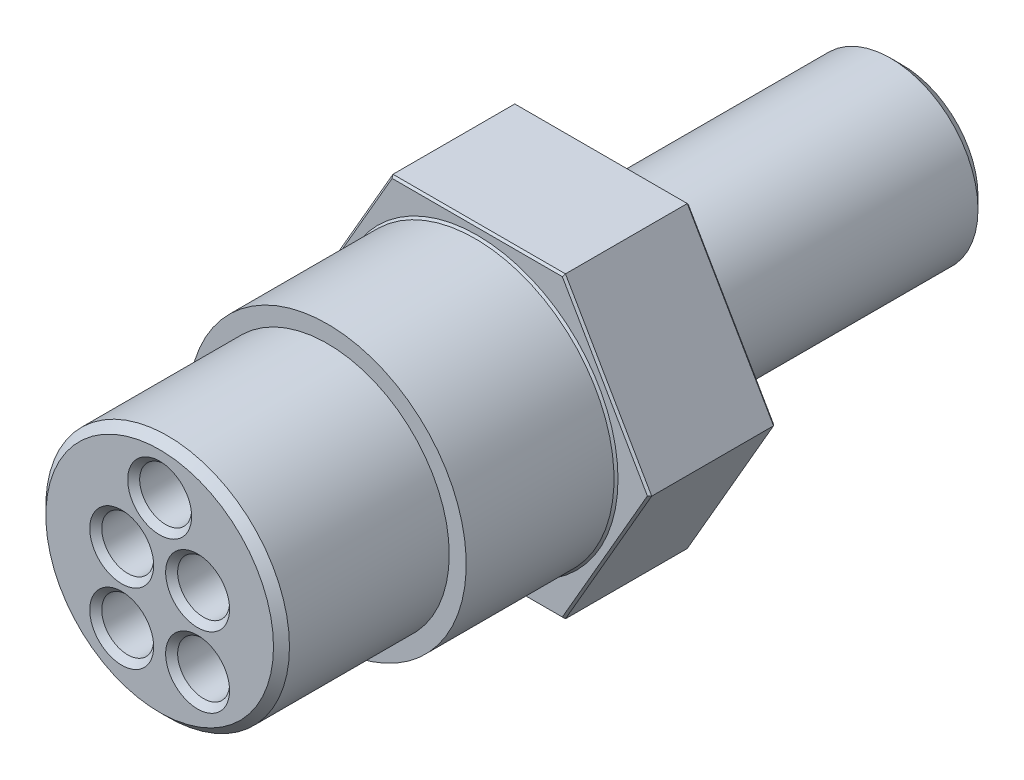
ISO-10303-21;
HEADER;
FILE_DESCRIPTION(('STEP AP214'),'2;1');
FILE_NAME('part.step','',(''),(''),'','','');
FILE_SCHEMA(('AUTOMOTIVE_DESIGN { 1 0 10303 214 1 1 1 1 }'));
ENDSEC;
DATA;
#1=APPLICATION_CONTEXT('core data for automotive mechanical design processes');
#2=APPLICATION_PROTOCOL_DEFINITION('international standard','automotive_design',2000,#1);
#3=PRODUCT_CONTEXT('',#1,'mechanical');
#4=PRODUCT('Part','Part','',(#3));
#5=PRODUCT_RELATED_PRODUCT_CATEGORY('part','',(#4));
#6=PRODUCT_DEFINITION_FORMATION('','',#4);
#7=PRODUCT_DEFINITION_CONTEXT('part definition',#1,'design');
#8=PRODUCT_DEFINITION('design','',#6,#7);
#9=PRODUCT_DEFINITION_SHAPE('','',#8);
#10=(LENGTH_UNIT() NAMED_UNIT(*) SI_UNIT(.MILLI.,.METRE.));
#11=(NAMED_UNIT(*) PLANE_ANGLE_UNIT() SI_UNIT($,.RADIAN.));
#12=(NAMED_UNIT(*) SI_UNIT($,.STERADIAN.) SOLID_ANGLE_UNIT());
#13=UNCERTAINTY_MEASURE_WITH_UNIT(LENGTH_MEASURE(1.E-05),#10,'distance_accuracy_value','');
#14=(GEOMETRIC_REPRESENTATION_CONTEXT(3) GLOBAL_UNCERTAINTY_ASSIGNED_CONTEXT((#13)) GLOBAL_UNIT_ASSIGNED_CONTEXT((#10,
#11,#12)) REPRESENTATION_CONTEXT('',''));
#15=CARTESIAN_POINT('',(0.,0.,0.));
#16=DIRECTION('',(0.,0.,1.));
#17=DIRECTION('',(1.,0.,0.));
#18=AXIS2_PLACEMENT_3D('',#15,#16,#17);
#19=CARTESIAN_POINT('',(0.,0.,17.526));
#20=DIRECTION('',(0.,0.,1.));
#21=DIRECTION('',(1.,0.,0.));
#22=AXIS2_PLACEMENT_3D('',#19,#20,#21);
#23=PLANE('',#22);
#24=CARTESIAN_POINT('',(0.,0.,17.526));
#25=DIRECTION('',(0.,0.,1.));
#26=DIRECTION('',(1.,0.,0.));
#27=AXIS2_PLACEMENT_3D('',#24,#25,#26);
#28=CIRCLE('',#27,8.8265);
#29=CARTESIAN_POINT('',(-8.8265,0.,17.526));
#30=VERTEX_POINT('',#29);
#31=EDGE_CURVE('E337',#30,#30,#28,.T.);
#32=ORIENTED_EDGE('',*,*,#31,.T.);
#33=EDGE_LOOP('',(#32));
#34=FACE_BOUND('',#33,.T.);
#35=CARTESIAN_POINT('',(0.,0.,17.526));
#36=DIRECTION('',(0.,0.,1.));
#37=DIRECTION('',(1.,0.,0.));
#38=AXIS2_PLACEMENT_3D('',#35,#36,#37);
#39=CIRCLE('',#38,7.747);
#40=CARTESIAN_POINT('',(7.747,0.,17.526));
#41=VERTEX_POINT('',#40);
#42=EDGE_CURVE('E373',#41,#41,#39,.T.);
#43=ORIENTED_EDGE('',*,*,#42,.F.);
#44=EDGE_LOOP('',(#43));
#45=FACE_BOUND('',#44,.T.);
#46=ADVANCED_FACE('F36',(#34,#45),#23,.T.);
#47=CARTESIAN_POINT('',(5.48459661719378,9.4996,8.001));
#48=DIRECTION('',(0.,0.,-1.));
#49=DIRECTION('',(-1.,0.,0.));
#50=AXIS2_PLACEMENT_3D('',#47,#48,#49);
#51=PLANE('',#50);
#52=CARTESIAN_POINT('',(0.,0.,8.001));
#53=DIRECTION('',(0.,0.,-1.));
#54=DIRECTION('',(-1.,0.,0.));
#55=AXIS2_PLACEMENT_3D('',#52,#53,#54);
#56=CIRCLE('',#55,8.95350000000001);
#57=CARTESIAN_POINT('',(-8.95350000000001,0.,8.001));
#58=VERTEX_POINT('',#57);
#59=EDGE_CURVE('E151',#58,#58,#56,.T.);
#60=ORIENTED_EDGE('',*,*,#59,.T.);
#61=EDGE_LOOP('',(#60));
#62=FACE_BOUND('',#61,.T.);
#63=DIRECTION('',(0.5,0.866025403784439,0.));
#64=VECTOR('',#63,1.);
#65=CARTESIAN_POINT('',(13.6015063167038,4.8133,8.001));
#66=LINE('',#65,#64);
#67=CARTESIAN_POINT('',(5.41127313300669,-9.3726,8.001));
#68=VERTEX_POINT('',#67);
#69=CARTESIAN_POINT('',(10.8225462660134,0.,8.001));
#70=VERTEX_POINT('',#69);
#71=EDGE_CURVE('E149',#68,#70,#66,.T.);
#72=ORIENTED_EDGE('',*,*,#71,.T.);
#73=DIRECTION('',(-0.5,0.866025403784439,0.));
#74=VECTOR('',#73,1.);
#75=CARTESIAN_POINT('',(5.37461139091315,9.4361,8.001));
#76=LINE('',#75,#74);
#77=CARTESIAN_POINT('',(5.41127313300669,9.37260000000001,8.001));
#78=VERTEX_POINT('',#77);
#79=EDGE_CURVE('E129',#70,#78,#76,.T.);
#80=ORIENTED_EDGE('',*,*,#79,.T.);
#81=DIRECTION('',(-1.,0.,0.));
#82=VECTOR('',#81,1.);
#83=CARTESIAN_POINT('',(5.48459661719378,9.37260000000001,8.001));
#84=LINE('',#83,#82);
#85=CARTESIAN_POINT('',(-5.41127313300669,9.3726,8.001));
#86=VERTEX_POINT('',#85);
#87=EDGE_CURVE('E138',#78,#86,#84,.T.);
#88=ORIENTED_EDGE('',*,*,#87,.T.);
#89=DIRECTION('',(-0.5,-0.866025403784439,0.));
#90=VECTOR('',#89,1.);
#91=CARTESIAN_POINT('',(-2.63231308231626,14.1859,8.001));
#92=LINE('',#91,#90);
#93=CARTESIAN_POINT('',(-10.8225462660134,0.,8.001));
#94=VERTEX_POINT('',#93);
#95=EDGE_CURVE('E144',#86,#94,#92,.T.);
#96=ORIENTED_EDGE('',*,*,#95,.T.);
#97=DIRECTION('',(0.5,-0.866025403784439,0.));
#98=VECTOR('',#97,1.);
#99=CARTESIAN_POINT('',(-10.8592080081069,0.0634999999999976,8.001));
#100=LINE('',#99,#98);
#101=CARTESIAN_POINT('',(-5.41127313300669,-9.3726,8.001));
#102=VERTEX_POINT('',#101);
#103=EDGE_CURVE('E313',#94,#102,#100,.T.);
#104=ORIENTED_EDGE('',*,*,#103,.T.);
#105=DIRECTION('',(1.,0.,0.));
#106=VECTOR('',#105,1.);
#107=CARTESIAN_POINT('',(5.48459661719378,-9.3726,8.001));
#108=LINE('',#107,#106);
#109=EDGE_CURVE('E156',#102,#68,#108,.T.);
#110=ORIENTED_EDGE('',*,*,#109,.T.);
#111=EDGE_LOOP('',(#72,#80,#88,#96,#104,#110));
#112=FACE_BOUND('',#111,.T.);
#113=ADVANCED_FACE('F147',(#62,#112),#51,.F.);
#114=CARTESIAN_POINT('',(0.,0.,-19.05));
#115=DIRECTION('',(0.,0.,1.));
#116=DIRECTION('',(1.,0.,0.));
#117=AXIS2_PLACEMENT_3D('',#114,#115,#116);
#118=CYLINDRICAL_SURFACE('',#117,5.55625);
#119=CARTESIAN_POINT('',(0.,0.,-18.288));
#120=DIRECTION('',(0.,0.,1.));
#121=DIRECTION('',(1.,0.,0.));
#122=AXIS2_PLACEMENT_3D('',#119,#120,#121);
#123=CIRCLE('',#122,5.55625);
#124=CARTESIAN_POINT('',(5.55625,0.,-18.288));
#125=VERTEX_POINT('',#124);
#126=EDGE_CURVE('E303',#125,#125,#123,.T.);
#127=CARTESIAN_POINT('',(0.,0.,0.));
#128=DIRECTION('',(0.,0.,1.));
#129=DIRECTION('',(1.,0.,0.));
#130=AXIS2_PLACEMENT_3D('',#127,#128,#129);
#131=CIRCLE('',#130,5.55625);
#132=CARTESIAN_POINT('',(5.55625,0.,0.));
#133=VERTEX_POINT('',#132);
#134=EDGE_CURVE('E308',#133,#133,#131,.T.);
#135=CARTESIAN_POINT('',(5.55625,0.,-18.288));
#136=CARTESIAN_POINT('',(5.55625,0.,-18.0975));
#137=CARTESIAN_POINT('',(5.55625,0.,-17.907));
#138=CARTESIAN_POINT('',(5.55625,0.,-17.526));
#139=CARTESIAN_POINT('',(5.55625,0.,-17.3355));
#140=CARTESIAN_POINT('',(5.55625,0.,-16.9545));
#141=CARTESIAN_POINT('',(5.55625,0.,-16.764));
#142=CARTESIAN_POINT('',(5.55625,0.,-16.383));
#143=CARTESIAN_POINT('',(5.55625,0.,-16.1925));
#144=CARTESIAN_POINT('',(5.55625,0.,-15.8115));
#145=CARTESIAN_POINT('',(5.55625,0.,-15.621));
#146=CARTESIAN_POINT('',(5.55625,0.,-15.24));
#147=CARTESIAN_POINT('',(5.55625,0.,-15.0495));
#148=CARTESIAN_POINT('',(5.55625,0.,-14.6685));
#149=CARTESIAN_POINT('',(5.55625,0.,-14.478));
#150=CARTESIAN_POINT('',(5.55625,0.,-14.097));
#151=CARTESIAN_POINT('',(5.55625,0.,-13.9065));
#152=CARTESIAN_POINT('',(5.55625,0.,-13.5255));
#153=CARTESIAN_POINT('',(5.55625,0.,-13.335));
#154=CARTESIAN_POINT('',(5.55625,0.,-12.954));
#155=CARTESIAN_POINT('',(5.55625,0.,-12.7635));
#156=CARTESIAN_POINT('',(5.55625,0.,-12.3825));
#157=CARTESIAN_POINT('',(5.55625,0.,-12.192));
#158=CARTESIAN_POINT('',(5.55625,0.,-11.811));
#159=CARTESIAN_POINT('',(5.55625,0.,-11.6205));
#160=CARTESIAN_POINT('',(5.55625,0.,-11.2395));
#161=CARTESIAN_POINT('',(5.55625,0.,-11.049));
#162=CARTESIAN_POINT('',(5.55625,0.,-10.668));
#163=CARTESIAN_POINT('',(5.55625,0.,-10.4775));
#164=CARTESIAN_POINT('',(5.55625,0.,-10.0965));
#165=CARTESIAN_POINT('',(5.55625,0.,-9.906));
#166=CARTESIAN_POINT('',(5.55625,0.,-9.525));
#167=CARTESIAN_POINT('',(5.55625,0.,-9.3345));
#168=CARTESIAN_POINT('',(5.55625,0.,-8.9535));
#169=CARTESIAN_POINT('',(5.55625,0.,-8.763));
#170=CARTESIAN_POINT('',(5.55625,0.,-8.382));
#171=CARTESIAN_POINT('',(5.55625,0.,-8.1915));
#172=CARTESIAN_POINT('',(5.55625,0.,-7.8105));
#173=CARTESIAN_POINT('',(5.55625,0.,-7.62));
#174=CARTESIAN_POINT('',(5.55625,0.,-7.239));
#175=CARTESIAN_POINT('',(5.55625,0.,-7.0485));
#176=CARTESIAN_POINT('',(5.55625,0.,-6.6675));
#177=CARTESIAN_POINT('',(5.55625,0.,-6.477));
#178=CARTESIAN_POINT('',(5.55625,0.,-6.096));
#179=CARTESIAN_POINT('',(5.55625,0.,-5.9055));
#180=CARTESIAN_POINT('',(5.55625,0.,-5.5245));
#181=CARTESIAN_POINT('',(5.55625,0.,-5.334));
#182=CARTESIAN_POINT('',(5.55625,0.,-4.953));
#183=CARTESIAN_POINT('',(5.55625,0.,-4.7625));
#184=CARTESIAN_POINT('',(5.55625,0.,-4.3815));
#185=CARTESIAN_POINT('',(5.55625,0.,-4.191));
#186=CARTESIAN_POINT('',(5.55625,0.,-3.81));
#187=CARTESIAN_POINT('',(5.55625,0.,-3.6195));
#188=CARTESIAN_POINT('',(5.55625,0.,-3.2385));
#189=CARTESIAN_POINT('',(5.55625,0.,-3.048));
#190=CARTESIAN_POINT('',(5.55625,0.,-2.667));
#191=CARTESIAN_POINT('',(5.55625,0.,-2.4765));
#192=CARTESIAN_POINT('',(5.55625,0.,-2.0955));
#193=CARTESIAN_POINT('',(5.55625,0.,-1.905));
#194=CARTESIAN_POINT('',(5.55625,0.,-1.524));
#195=CARTESIAN_POINT('',(5.55625,0.,-1.3335));
#196=CARTESIAN_POINT('',(5.55625,0.,-0.952499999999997));
#197=CARTESIAN_POINT('',(5.55625,0.,-0.761999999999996));
#198=CARTESIAN_POINT('',(5.55625,0.,-0.380999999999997));
#199=CARTESIAN_POINT('',(5.55625,0.,-0.190499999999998));
#200=CARTESIAN_POINT('',(5.55625,0.,0.));
#201=B_SPLINE_CURVE_WITH_KNOTS('',3,(#135,#136,#137,#138,#139,#140,#141,#142,#143,#144,#145,
#146,#147,#148,#149,#150,#151,#152,#153,#154,#155,#156,#157,#158,#159,#160,#161,#162,#163,#164,
#165,#166,#167,#168,#169,#170,#171,#172,#173,#174,#175,#176,#177,#178,#179,#180,#181,#182,#183,
#184,#185,#186,#187,#188,#189,#190,#191,#192,#193,#194,#195,#196,#197,#198,#199,#200),
.UNSPECIFIED.,.F.,.F.,(4,2,2,2,2,2,2,2,2,2,2,2,2,2,2,2,2,2,2,2,2,2,2,2,2,2,2,2,2,2,2,2,4),(0.,
0.571500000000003,1.143,1.7145,2.286,2.8575,3.429,4.0005,4.572,5.1435,5.715,6.2865,6.858,7.4295,
8.001,8.5725,9.144,9.7155,10.287,10.8585,11.43,12.0015,12.573,13.1445,13.716,14.2875,14.859,
15.4305,16.002,16.5735,17.145,17.7165,18.288),.UNSPECIFIED.);
#202=EDGE_CURVE('BSEAM38',#125,#133,#201,.T.);
#203=ORIENTED_EDGE('',*,*,#126,.T.);
#204=ORIENTED_EDGE('',*,*,#134,.F.);
#205=ORIENTED_EDGE('',*,*,#202,.T.);
#206=ORIENTED_EDGE('',*,*,#202,.F.);
#207=EDGE_LOOP('',(#203,#205,#204,#206));
#208=FACE_BOUND('',#207,.T.);
#209=ADVANCED_FACE('F38',(#208),#118,.T.);
#210=CARTESIAN_POINT('',(0.,0.,-19.05));
#211=DIRECTION('',(0.,0.,1.));
#212=DIRECTION('',(1.,0.,0.));
#213=AXIS2_PLACEMENT_3D('',#210,#211,#212);
#214=PLANE('',#213);
#215=CARTESIAN_POINT('',(0.,0.,-19.05));
#216=DIRECTION('',(0.,0.,1.));
#217=DIRECTION('',(1.,0.,0.));
#218=AXIS2_PLACEMENT_3D('',#215,#216,#217);
#219=CIRCLE('',#218,4.79425);
#220=CARTESIAN_POINT('',(4.79425,0.,-19.05));
#221=VERTEX_POINT('',#220);
#222=EDGE_CURVE('E302',#221,#221,#219,.F.);
#223=ORIENTED_EDGE('',*,*,#222,.T.);
#224=EDGE_LOOP('',(#223));
#225=FACE_BOUND('',#224,.T.);
#226=ADVANCED_FACE('F292',(#225),#214,.F.);
#227=CARTESIAN_POINT('',(0.,0.,-18.288));
#228=DIRECTION('',(0.,0.,1.));
#229=DIRECTION('',(1.,0.,0.));
#230=AXIS2_PLACEMENT_3D('',#227,#228,#229);
#231=CONICAL_SURFACE('',#230,5.55625,0.785398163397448);
#232=ORIENTED_EDGE('',*,*,#222,.F.);
#233=EDGE_LOOP('',(#232));
#234=FACE_BOUND('',#233,.T.);
#235=ORIENTED_EDGE('',*,*,#126,.F.);
#236=EDGE_LOOP('',(#235));
#237=FACE_BOUND('',#236,.T.);
#238=ADVANCED_FACE('F289',(#234,#237),#231,.T.);
#239=CARTESIAN_POINT('',(5.48459661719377,9.4996,8.001));
#240=DIRECTION('',(0.,-1.,0.));
#241=DIRECTION('',(1.,0.,0.));
#242=AXIS2_PLACEMENT_3D('',#239,#240,#241);
#243=PLANE('',#242);
#244=DIRECTION('',(0.,0.,-1.));
#245=VECTOR('',#244,1.);
#246=CARTESIAN_POINT('',(-5.48459661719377,9.4996,8.001));
#247=LINE('',#246,#245);
#248=CARTESIAN_POINT('',(-5.48459661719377,9.4996,7.874));
#249=VERTEX_POINT('',#248);
#250=CARTESIAN_POINT('',(-5.48459661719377,9.4996,0.126999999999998));
#251=VERTEX_POINT('',#250);
#252=EDGE_CURVE('E357',#249,#251,#247,.T.);
#253=ORIENTED_EDGE('',*,*,#252,.F.);
#254=DIRECTION('',(1.,0.,0.));
#255=VECTOR('',#254,1.);
#256=CARTESIAN_POINT('',(5.48459661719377,9.4996,7.874));
#257=LINE('',#256,#255);
#258=CARTESIAN_POINT('',(5.48459661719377,9.4996,7.874));
#259=VERTEX_POINT('',#258);
#260=EDGE_CURVE('E183',#249,#259,#257,.T.);
#261=ORIENTED_EDGE('',*,*,#260,.T.);
#262=DIRECTION('',(0.,0.,-1.));
#263=VECTOR('',#262,1.);
#264=CARTESIAN_POINT('',(5.48459661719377,9.4996,8.001));
#265=LINE('',#264,#263);
#266=CARTESIAN_POINT('',(5.48459661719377,9.4996,0.127));
#267=VERTEX_POINT('',#266);
#268=EDGE_CURVE('E342',#259,#267,#265,.T.);
#269=ORIENTED_EDGE('',*,*,#268,.T.);
#270=DIRECTION('',(-1.,0.,0.));
#271=VECTOR('',#270,1.);
#272=CARTESIAN_POINT('',(-5.48459661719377,9.4996,0.127));
#273=LINE('',#272,#271);
#274=EDGE_CURVE('E180',#267,#251,#273,.T.);
#275=ORIENTED_EDGE('',*,*,#274,.T.);
#276=EDGE_LOOP('',(#253,#261,#269,#275));
#277=FACE_BOUND('',#276,.T.);
#278=ADVANCED_FACE('F285',(#277),#243,.F.);
#279=CARTESIAN_POINT('',(-5.48459661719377,9.4996,8.001));
#280=DIRECTION('',(0.866025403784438,-0.5,0.));
#281=DIRECTION('',(0.5,0.866025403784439,0.));
#282=AXIS2_PLACEMENT_3D('',#279,#280,#281);
#283=PLANE('',#282);
#284=DIRECTION('',(0.,0.,-1.));
#285=VECTOR('',#284,1.);
#286=CARTESIAN_POINT('',(-10.9691932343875,0.,8.001));
#287=LINE('',#286,#285);
#288=CARTESIAN_POINT('',(-10.9691932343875,0.,7.874));
#289=VERTEX_POINT('',#288);
#290=CARTESIAN_POINT('',(-10.9691932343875,0.,0.127000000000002));
#291=VERTEX_POINT('',#290);
#292=EDGE_CURVE('E354',#289,#291,#287,.T.);
#293=ORIENTED_EDGE('',*,*,#292,.F.);
#294=DIRECTION('',(0.5,0.866025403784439,0.));
#295=VECTOR('',#294,1.);
#296=CARTESIAN_POINT('',(-5.48459661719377,9.4996,7.874));
#297=LINE('',#296,#295);
#298=EDGE_CURVE('E178',#289,#249,#297,.T.);
#299=ORIENTED_EDGE('',*,*,#298,.T.);
#300=ORIENTED_EDGE('',*,*,#252,.T.);
#301=DIRECTION('',(-0.377964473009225,-0.654653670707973,-0.654653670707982));
#302=VECTOR('',#301,1.);
#303=CARTESIAN_POINT('',(-3.91756901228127,12.2137714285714,2.84117142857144));
#304=LINE('',#303,#302);
#305=CARTESIAN_POINT('',(-5.55792010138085,9.3726,0.));
#306=VERTEX_POINT('',#305);
#307=EDGE_CURVE('E176',#251,#306,#304,.T.);
#308=ORIENTED_EDGE('',*,*,#307,.T.);
#309=DIRECTION('',(-0.5,-0.866025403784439,0.));
#310=VECTOR('',#309,1.);
#311=CARTESIAN_POINT('',(-5.48459661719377,9.4996,0.));
#312=LINE('',#311,#310);
#313=CARTESIAN_POINT('',(-10.8958697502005,0.127000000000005,0.));
#314=VERTEX_POINT('',#313);
#315=EDGE_CURVE('E339',#306,#314,#312,.T.);
#316=ORIENTED_EDGE('',*,*,#315,.T.);
#317=DIRECTION('',(-0.377964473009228,-0.654653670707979,0.654653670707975));
#318=VECTOR('',#317,1.);
#319=CARTESIAN_POINT('',(-10.9691932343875,0.,0.127000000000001));
#320=LINE('',#319,#318);
#321=EDGE_CURVE('E174',#314,#291,#320,.T.);
#322=ORIENTED_EDGE('',*,*,#321,.T.);
#323=EDGE_LOOP('',(#293,#299,#300,#308,#316,#322));
#324=FACE_BOUND('',#323,.T.);
#325=ADVANCED_FACE('F281',(#324),#283,.F.);
#326=CARTESIAN_POINT('',(-10.9691932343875,0.,8.001));
#327=DIRECTION('',(0.866025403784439,0.5,0.));
#328=DIRECTION('',(-0.5,0.866025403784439,0.));
#329=AXIS2_PLACEMENT_3D('',#326,#327,#328);
#330=PLANE('',#329);
#331=DIRECTION('',(0.,0.,-1.));
#332=VECTOR('',#331,1.);
#333=CARTESIAN_POINT('',(-5.48459661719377,-9.4996,8.001));
#334=LINE('',#333,#332);
#335=CARTESIAN_POINT('',(-5.48459661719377,-9.4996,7.874));
#336=VERTEX_POINT('',#335);
#337=CARTESIAN_POINT('',(-5.48459661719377,-9.4996,0.127));
#338=VERTEX_POINT('',#337);
#339=EDGE_CURVE('E351',#336,#338,#334,.T.);
#340=ORIENTED_EDGE('',*,*,#339,.F.);
#341=DIRECTION('',(-0.5,0.866025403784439,0.));
#342=VECTOR('',#341,1.);
#343=CARTESIAN_POINT('',(-10.9691932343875,0.,7.874));
#344=LINE('',#343,#342);
#345=EDGE_CURVE('E172',#336,#289,#344,.T.);
#346=ORIENTED_EDGE('',*,*,#345,.T.);
#347=ORIENTED_EDGE('',*,*,#292,.T.);
#348=DIRECTION('',(0.5,-0.866025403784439,0.));
#349=VECTOR('',#348,1.);
#350=CARTESIAN_POINT('',(-5.48459661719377,-9.4996,0.127));
#351=LINE('',#350,#349);
#352=EDGE_CURVE('E170',#291,#338,#351,.T.);
#353=ORIENTED_EDGE('',*,*,#352,.T.);
#354=EDGE_LOOP('',(#340,#346,#347,#353));
#355=FACE_BOUND('',#354,.T.);
#356=ADVANCED_FACE('F277',(#355),#330,.F.);
#357=CARTESIAN_POINT('',(-5.48459661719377,-9.4996,8.001));
#358=DIRECTION('',(0.,1.,0.));
#359=DIRECTION('',(-1.,0.,0.));
#360=AXIS2_PLACEMENT_3D('',#357,#358,#359);
#361=PLANE('',#360);
#362=DIRECTION('',(0.,0.,-1.));
#363=VECTOR('',#362,1.);
#364=CARTESIAN_POINT('',(5.48459661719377,-9.4996,8.001));
#365=LINE('',#364,#363);
#366=CARTESIAN_POINT('',(5.48459661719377,-9.4996,7.874));
#367=VERTEX_POINT('',#366);
#368=CARTESIAN_POINT('',(5.48459661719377,-9.4996,0.127));
#369=VERTEX_POINT('',#368);
#370=EDGE_CURVE('E348',#367,#369,#365,.T.);
#371=ORIENTED_EDGE('',*,*,#370,.F.);
#372=DIRECTION('',(-1.,0.,0.));
#373=VECTOR('',#372,1.);
#374=CARTESIAN_POINT('',(-5.48459661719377,-9.4996,7.874));
#375=LINE('',#374,#373);
#376=EDGE_CURVE('E168',#367,#336,#375,.T.);
#377=ORIENTED_EDGE('',*,*,#376,.T.);
#378=ORIENTED_EDGE('',*,*,#339,.T.);
#379=DIRECTION('',(1.,0.,0.));
#380=VECTOR('',#379,1.);
#381=CARTESIAN_POINT('',(5.48459661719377,-9.4996,0.127));
#382=LINE('',#381,#380);
#383=EDGE_CURVE('E166',#338,#369,#382,.T.);
#384=ORIENTED_EDGE('',*,*,#383,.T.);
#385=EDGE_LOOP('',(#371,#377,#378,#384));
#386=FACE_BOUND('',#385,.T.);
#387=ADVANCED_FACE('F273',(#386),#361,.F.);
#388=CARTESIAN_POINT('',(5.48459661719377,-9.4996,8.001));
#389=DIRECTION('',(-0.866025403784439,0.5,0.));
#390=DIRECTION('',(-0.5,-0.866025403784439,0.));
#391=AXIS2_PLACEMENT_3D('',#388,#389,#390);
#392=PLANE('',#391);
#393=DIRECTION('',(0.,0.,-1.));
#394=VECTOR('',#393,1.);
#395=CARTESIAN_POINT('',(10.9691932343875,0.,8.001));
#396=LINE('',#395,#394);
#397=CARTESIAN_POINT('',(10.9691932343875,0.,7.874));
#398=VERTEX_POINT('',#397);
#399=CARTESIAN_POINT('',(10.9691932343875,0.,0.127));
#400=VERTEX_POINT('',#399);
#401=EDGE_CURVE('E345',#398,#400,#396,.T.);
#402=ORIENTED_EDGE('',*,*,#401,.F.);
#403=DIRECTION('',(-0.5,-0.866025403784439,0.));
#404=VECTOR('',#403,1.);
#405=CARTESIAN_POINT('',(5.48459661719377,-9.4996,7.874));
#406=LINE('',#405,#404);
#407=EDGE_CURVE('E164',#398,#367,#406,.T.);
#408=ORIENTED_EDGE('',*,*,#407,.T.);
#409=ORIENTED_EDGE('',*,*,#370,.T.);
#410=DIRECTION('',(0.5,0.866025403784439,0.));
#411=VECTOR('',#410,1.);
#412=CARTESIAN_POINT('',(10.9691932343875,0.,0.127));
#413=LINE('',#412,#411);
#414=EDGE_CURVE('E162',#369,#400,#413,.T.);
#415=ORIENTED_EDGE('',*,*,#414,.T.);
#416=EDGE_LOOP('',(#402,#408,#409,#415));
#417=FACE_BOUND('',#416,.T.);
#418=ADVANCED_FACE('F269',(#417),#392,.F.);
#419=CARTESIAN_POINT('',(10.9691932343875,0.,8.001));
#420=DIRECTION('',(-0.866025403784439,-0.5,0.));
#421=DIRECTION('',(0.5,-0.866025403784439,0.));
#422=AXIS2_PLACEMENT_3D('',#419,#420,#421);
#423=PLANE('',#422);
#424=ORIENTED_EDGE('',*,*,#268,.F.);
#425=DIRECTION('',(0.5,-0.866025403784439,0.));
#426=VECTOR('',#425,1.);
#427=CARTESIAN_POINT('',(10.9691932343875,0.,7.874));
#428=LINE('',#427,#426);
#429=EDGE_CURVE('E131',#259,#398,#428,.T.);
#430=ORIENTED_EDGE('',*,*,#429,.T.);
#431=ORIENTED_EDGE('',*,*,#401,.T.);
#432=DIRECTION('',(-0.5,0.866025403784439,0.));
#433=VECTOR('',#432,1.);
#434=CARTESIAN_POINT('',(5.48459661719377,9.4996,0.127));
#435=LINE('',#434,#433);
#436=EDGE_CURVE('E154',#400,#267,#435,.T.);
#437=ORIENTED_EDGE('',*,*,#436,.T.);
#438=EDGE_LOOP('',(#424,#430,#431,#437));
#439=FACE_BOUND('',#438,.T.);
#440=ADVANCED_FACE('F264',(#439),#423,.F.);
#441=CARTESIAN_POINT('',(5.48459661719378,9.4996,0.));
#442=DIRECTION('',(0.,0.,-1.));
#443=DIRECTION('',(-1.,0.,0.));
#444=AXIS2_PLACEMENT_3D('',#441,#442,#443);
#445=PLANE('',#444);
#446=ORIENTED_EDGE('',*,*,#134,.T.);
#447=EDGE_LOOP('',(#446));
#448=FACE_BOUND('',#447,.T.);
#449=ORIENTED_EDGE('',*,*,#315,.F.);
#450=DIRECTION('',(1.,0.,0.));
#451=VECTOR('',#450,1.);
#452=CARTESIAN_POINT('',(5.48459661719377,9.37260000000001,0.));
#453=LINE('',#452,#451);
#454=CARTESIAN_POINT('',(5.41127313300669,9.37260000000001,0.));
#455=VERTEX_POINT('',#454);
#456=EDGE_CURVE('E51',#306,#455,#453,.T.);
#457=ORIENTED_EDGE('',*,*,#456,.T.);
#458=DIRECTION('',(0.5,-0.866025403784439,0.));
#459=VECTOR('',#458,1.);
#460=CARTESIAN_POINT('',(10.8592080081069,-0.0634999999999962,0.));
#461=LINE('',#460,#459);
#462=CARTESIAN_POINT('',(10.8225462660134,0.,0.));
#463=VERTEX_POINT('',#462);
#464=EDGE_CURVE('E55',#455,#463,#461,.T.);
#465=ORIENTED_EDGE('',*,*,#464,.T.);
#466=DIRECTION('',(-0.5,-0.866025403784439,0.));
#467=VECTOR('',#466,1.);
#468=CARTESIAN_POINT('',(5.37461139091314,-9.43609999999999,0.));
#469=LINE('',#468,#467);
#470=CARTESIAN_POINT('',(5.41127313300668,-9.3726,0.));
#471=VERTEX_POINT('',#470);
#472=EDGE_CURVE('E189',#463,#471,#469,.T.);
#473=ORIENTED_EDGE('',*,*,#472,.T.);
#474=DIRECTION('',(-1.,0.,0.));
#475=VECTOR('',#474,1.);
#476=CARTESIAN_POINT('',(-5.48459661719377,-9.3726,0.));
#477=LINE('',#476,#475);
#478=CARTESIAN_POINT('',(-5.41127313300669,-9.3726,0.));
#479=VERTEX_POINT('',#478);
#480=EDGE_CURVE('E187',#471,#479,#477,.T.);
#481=ORIENTED_EDGE('',*,*,#480,.T.);
#482=DIRECTION('',(-0.5,0.866025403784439,0.));
#483=VECTOR('',#482,1.);
#484=CARTESIAN_POINT('',(-10.8592080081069,0.0635000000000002,0.));
#485=LINE('',#484,#483);
#486=EDGE_CURVE('E185',#479,#314,#485,.T.);
#487=ORIENTED_EDGE('',*,*,#486,.T.);
#488=EDGE_LOOP('',(#449,#457,#465,#473,#481,#487));
#489=FACE_BOUND('',#488,.T.);
#490=ADVANCED_FACE('F261',(#448,#489),#445,.T.);
#491=CARTESIAN_POINT('',(0.,0.,17.526));
#492=DIRECTION('',(0.,0.,-1.));
#493=DIRECTION('',(-1.,0.,0.));
#494=AXIS2_PLACEMENT_3D('',#491,#492,#493);
#495=CYLINDRICAL_SURFACE('',#494,8.8265);
#496=CARTESIAN_POINT('',(0.,0.,8.12800000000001));
#497=DIRECTION('',(0.,0.,-1.));
#498=DIRECTION('',(-1.,0.,0.));
#499=AXIS2_PLACEMENT_3D('',#496,#497,#498);
#500=CIRCLE('',#499,8.8265);
#501=CARTESIAN_POINT('',(-8.8265,0.,8.12800000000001));
#502=VERTEX_POINT('',#501);
#503=EDGE_CURVE('E145',#502,#502,#500,.F.);
#504=CARTESIAN_POINT('',(-8.8265,0.,8.12800000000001));
#505=CARTESIAN_POINT('',(-8.8265,0.,8.22589583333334));
#506=CARTESIAN_POINT('',(-8.8265,0.,8.32379166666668));
#507=CARTESIAN_POINT('',(-8.8265,0.,8.51958333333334));
#508=CARTESIAN_POINT('',(-8.8265,0.,8.61747916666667));
#509=CARTESIAN_POINT('',(-8.8265,0.,8.81327083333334));
#510=CARTESIAN_POINT('',(-8.8265,0.,8.91116666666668));
#511=CARTESIAN_POINT('',(-8.8265,0.,9.10695833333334));
#512=CARTESIAN_POINT('',(-8.8265,0.,9.20485416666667));
#513=CARTESIAN_POINT('',(-8.8265,0.,9.40064583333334));
#514=CARTESIAN_POINT('',(-8.8265,0.,9.49854166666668));
#515=CARTESIAN_POINT('',(-8.8265,0.,9.69433333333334));
#516=CARTESIAN_POINT('',(-8.8265,0.,9.79222916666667));
#517=CARTESIAN_POINT('',(-8.8265,0.,9.98802083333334));
#518=CARTESIAN_POINT('',(-8.8265,0.,10.0859166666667));
#519=CARTESIAN_POINT('',(-8.8265,0.,10.2817083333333));
#520=CARTESIAN_POINT('',(-8.8265,0.,10.3796041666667));
#521=CARTESIAN_POINT('',(-8.8265,0.,10.5753958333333));
#522=CARTESIAN_POINT('',(-8.8265,0.,10.6732916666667));
#523=CARTESIAN_POINT('',(-8.8265,0.,10.8690833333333));
#524=CARTESIAN_POINT('',(-8.8265,0.,10.9669791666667));
#525=CARTESIAN_POINT('',(-8.8265,0.,11.1627708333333));
#526=CARTESIAN_POINT('',(-8.8265,0.,11.2606666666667));
#527=CARTESIAN_POINT('',(-8.8265,0.,11.4564583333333));
#528=CARTESIAN_POINT('',(-8.8265,0.,11.5543541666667));
#529=CARTESIAN_POINT('',(-8.8265,0.,11.7501458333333));
#530=CARTESIAN_POINT('',(-8.8265,0.,11.8480416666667));
#531=CARTESIAN_POINT('',(-8.8265,0.,12.0438333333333));
#532=CARTESIAN_POINT('',(-8.8265,0.,12.1417291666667));
#533=CARTESIAN_POINT('',(-8.8265,0.,12.3375208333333));
#534=CARTESIAN_POINT('',(-8.8265,0.,12.4354166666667));
#535=CARTESIAN_POINT('',(-8.8265,0.,12.6312083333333));
#536=CARTESIAN_POINT('',(-8.8265,0.,12.7291041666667));
#537=CARTESIAN_POINT('',(-8.8265,0.,12.9248958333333));
#538=CARTESIAN_POINT('',(-8.8265,0.,13.0227916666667));
#539=CARTESIAN_POINT('',(-8.8265,0.,13.2185833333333));
#540=CARTESIAN_POINT('',(-8.8265,0.,13.3164791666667));
#541=CARTESIAN_POINT('',(-8.8265,0.,13.5122708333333));
#542=CARTESIAN_POINT('',(-8.8265,0.,13.6101666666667));
#543=CARTESIAN_POINT('',(-8.8265,0.,13.8059583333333));
#544=CARTESIAN_POINT('',(-8.8265,0.,13.9038541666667));
#545=CARTESIAN_POINT('',(-8.8265,0.,14.0996458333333));
#546=CARTESIAN_POINT('',(-8.8265,0.,14.1975416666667));
#547=CARTESIAN_POINT('',(-8.8265,0.,14.3933333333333));
#548=CARTESIAN_POINT('',(-8.8265,0.,14.4912291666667));
#549=CARTESIAN_POINT('',(-8.8265,0.,14.6870208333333));
#550=CARTESIAN_POINT('',(-8.8265,0.,14.7849166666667));
#551=CARTESIAN_POINT('',(-8.8265,0.,14.9807083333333));
#552=CARTESIAN_POINT('',(-8.8265,0.,15.0786041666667));
#553=CARTESIAN_POINT('',(-8.8265,0.,15.2743958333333));
#554=CARTESIAN_POINT('',(-8.8265,0.,15.3722916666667));
#555=CARTESIAN_POINT('',(-8.8265,0.,15.5680833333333));
#556=CARTESIAN_POINT('',(-8.8265,0.,15.6659791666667));
#557=CARTESIAN_POINT('',(-8.8265,0.,15.8617708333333));
#558=CARTESIAN_POINT('',(-8.8265,0.,15.9596666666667));
#559=CARTESIAN_POINT('',(-8.8265,0.,16.1554583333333));
#560=CARTESIAN_POINT('',(-8.8265,0.,16.2533541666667));
#561=CARTESIAN_POINT('',(-8.8265,0.,16.4491458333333));
#562=CARTESIAN_POINT('',(-8.8265,0.,16.5470416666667));
#563=CARTESIAN_POINT('',(-8.8265,0.,16.7428333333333));
#564=CARTESIAN_POINT('',(-8.8265,0.,16.8407291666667));
#565=CARTESIAN_POINT('',(-8.8265,0.,17.0365208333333));
#566=CARTESIAN_POINT('',(-8.8265,0.,17.1344166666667));
#567=CARTESIAN_POINT('',(-8.8265,0.,17.3302083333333));
#568=CARTESIAN_POINT('',(-8.8265,0.,17.4281041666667));
#569=CARTESIAN_POINT('',(-8.8265,0.,17.526));
#570=B_SPLINE_CURVE_WITH_KNOTS('',3,(#504,#505,#506,#507,#508,#509,#510,#511,#512,#513,#514,
#515,#516,#517,#518,#519,#520,#521,#522,#523,#524,#525,#526,#527,#528,#529,#530,#531,#532,#533,
#534,#535,#536,#537,#538,#539,#540,#541,#542,#543,#544,#545,#546,#547,#548,#549,#550,#551,#552,
#553,#554,#555,#556,#557,#558,#559,#560,#561,#562,#563,#564,#565,#566,#567,#568,#569),
.UNSPECIFIED.,.F.,.F.,(4,2,2,2,2,2,2,2,2,2,2,2,2,2,2,2,2,2,2,2,2,2,2,2,2,2,2,2,2,2,2,2,4),(0.,
0.293687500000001,0.587374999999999,0.8810625,1.17475,1.4684375,1.762125,2.0558125,2.3495,
2.6431875,2.936875,3.2305625,3.52425,3.81793749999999,4.111625,4.4053125,4.69899999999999,
4.99268749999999,5.28637499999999,5.58006249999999,5.87374999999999,6.16743749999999,
6.46112499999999,6.75481249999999,7.04849999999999,7.34218749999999,7.63587499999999,
7.92956249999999,8.22324999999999,8.51693749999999,8.81062499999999,9.10431249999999,
9.39799999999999),.UNSPECIFIED.);
#571=EDGE_CURVE('BSEAM258',#502,#30,#570,.T.);
#572=ORIENTED_EDGE('',*,*,#503,.T.);
#573=ORIENTED_EDGE('',*,*,#31,.F.);
#574=ORIENTED_EDGE('',*,*,#571,.T.);
#575=ORIENTED_EDGE('',*,*,#571,.F.);
#576=EDGE_LOOP('',(#572,#574,#573,#575));
#577=FACE_BOUND('',#576,.T.);
#578=ADVANCED_FACE('F258',(#577),#495,.T.);
#579=CARTESIAN_POINT('',(0.,0.,8.12800000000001));
#580=DIRECTION('',(0.,0.,-1.));
#581=DIRECTION('',(-1.,0.,0.));
#582=AXIS2_PLACEMENT_3D('',#579,#580,#581);
#583=CONICAL_SURFACE('',#582,8.8265,0.785398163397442);
#584=ORIENTED_EDGE('',*,*,#59,.F.);
#585=EDGE_LOOP('',(#584));
#586=FACE_BOUND('',#585,.T.);
#587=ORIENTED_EDGE('',*,*,#503,.F.);
#588=EDGE_LOOP('',(#587));
#589=FACE_BOUND('',#588,.T.);
#590=ADVANCED_FACE('F256',(#586,#589),#583,.T.);
#591=CARTESIAN_POINT('',(-10.8592080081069,0.0634999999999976,8.001));
#592=DIRECTION('',(0.612372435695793,0.353553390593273,-0.707106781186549));
#593=DIRECTION('',(-0.755928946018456,0.,-0.654653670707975));
#594=AXIS2_PLACEMENT_3D('',#591,#592,#593);
#595=PLANE('',#594);
#596=DIRECTION('',(0.755928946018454,0.,0.654653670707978));
#597=VECTOR('',#596,1.);
#598=CARTESIAN_POINT('',(-6.14241301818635,0.,12.0541142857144));
#599=LINE('',#598,#597);
#600=EDGE_CURVE('E326',#289,#94,#599,.T.);
#601=ORIENTED_EDGE('',*,*,#600,.F.);
#602=ORIENTED_EDGE('',*,*,#345,.F.);
#603=DIRECTION('',(0.377964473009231,0.654653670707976,0.654653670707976));
#604=VECTOR('',#603,1.);
#605=CARTESIAN_POINT('',(-3.85472031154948,-6.67657142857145,10.6970285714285));
#606=LINE('',#605,#604);
#607=EDGE_CURVE('E335',#102,#336,#606,.F.);
#608=ORIENTED_EDGE('',*,*,#607,.F.);
#609=ORIENTED_EDGE('',*,*,#103,.F.);
#610=EDGE_LOOP('',(#601,#602,#608,#609));
#611=FACE_BOUND('',#610,.T.);
#612=ADVANCED_FACE('F399',(#611),#595,.F.);
#613=CARTESIAN_POINT('',(5.48459661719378,-9.3726,8.001));
#614=DIRECTION('',(0.,0.707106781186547,-0.707106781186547));
#615=DIRECTION('',(0.,0.707106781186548,0.707106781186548));
#616=AXIS2_PLACEMENT_3D('',#613,#614,#615);
#617=PLANE('',#616);
#618=ORIENTED_EDGE('',*,*,#607,.T.);
#619=ORIENTED_EDGE('',*,*,#376,.F.);
#620=DIRECTION('',(-0.377964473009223,0.654653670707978,0.654653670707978));
#621=VECTOR('',#620,1.);
#622=CARTESIAN_POINT('',(5.42174791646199,-9.39074285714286,7.98285714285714));
#623=LINE('',#622,#621);
#624=EDGE_CURVE('E322',#68,#367,#623,.F.);
#625=ORIENTED_EDGE('',*,*,#624,.F.);
#626=ORIENTED_EDGE('',*,*,#109,.F.);
#627=EDGE_LOOP('',(#618,#619,#625,#626));
#628=FACE_BOUND('',#627,.T.);
#629=ADVANCED_FACE('F323',(#628),#617,.F.);
#630=CARTESIAN_POINT('',(-2.63231308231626,14.1859,8.001));
#631=DIRECTION('',(0.612372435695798,-0.353553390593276,-0.707106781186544));
#632=DIRECTION('',(-0.755928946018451,0.,-0.654653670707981));
#633=AXIS2_PLACEMENT_3D('',#630,#631,#632);
#634=PLANE('',#633);
#635=ORIENTED_EDGE('',*,*,#600,.T.);
#636=ORIENTED_EDGE('',*,*,#95,.F.);
#637=DIRECTION('',(0.377964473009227,-0.654653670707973,0.654653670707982));
#638=VECTOR('',#637,1.);
#639=CARTESIAN_POINT('',(-3.85472031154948,6.67657142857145,10.6970285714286));
#640=LINE('',#639,#638);
#641=EDGE_CURVE('E141',#249,#86,#640,.T.);
#642=ORIENTED_EDGE('',*,*,#641,.F.);
#643=ORIENTED_EDGE('',*,*,#298,.F.);
#644=EDGE_LOOP('',(#635,#636,#642,#643));
#645=FACE_BOUND('',#644,.T.);
#646=ADVANCED_FACE('F402',(#645),#634,.F.);
#647=CARTESIAN_POINT('',(13.6015063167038,4.8133,8.001));
#648=DIRECTION('',(-0.612372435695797,0.353553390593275,-0.707106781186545));
#649=DIRECTION('',(-0.755928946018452,0.,0.65465367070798));
#650=AXIS2_PLACEMENT_3D('',#647,#648,#649);
#651=PLANE('',#650);
#652=ORIENTED_EDGE('',*,*,#624,.T.);
#653=ORIENTED_EDGE('',*,*,#407,.F.);
#654=DIRECTION('',(-0.755928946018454,0.,0.654653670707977));
#655=VECTOR('',#654,1.);
#656=CARTESIAN_POINT('',(12.4105234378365,0.,6.6257714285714));
#657=LINE('',#656,#655);
#658=EDGE_CURVE('E134',#70,#398,#657,.F.);
#659=ORIENTED_EDGE('',*,*,#658,.F.);
#660=ORIENTED_EDGE('',*,*,#71,.F.);
#661=EDGE_LOOP('',(#652,#653,#659,#660));
#662=FACE_BOUND('',#661,.T.);
#663=ADVANCED_FACE('F328',(#662),#651,.F.);
#664=CARTESIAN_POINT('',(5.48459661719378,9.37260000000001,8.001));
#665=DIRECTION('',(0.,-0.707106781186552,-0.707106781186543));
#666=DIRECTION('',(0.,0.707106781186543,-0.707106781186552));
#667=AXIS2_PLACEMENT_3D('',#664,#665,#666);
#668=PLANE('',#667);
#669=ORIENTED_EDGE('',*,*,#641,.T.);
#670=ORIENTED_EDGE('',*,*,#87,.F.);
#671=DIRECTION('',(0.377964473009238,0.65465367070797,-0.654653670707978));
#672=VECTOR('',#671,1.);
#673=CARTESIAN_POINT('',(5.42174791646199,9.39074285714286,7.98285714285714));
#674=LINE('',#673,#672);
#675=EDGE_CURVE('E125',#259,#78,#674,.F.);
#676=ORIENTED_EDGE('',*,*,#675,.F.);
#677=ORIENTED_EDGE('',*,*,#260,.F.);
#678=EDGE_LOOP('',(#669,#670,#676,#677));
#679=FACE_BOUND('',#678,.T.);
#680=ADVANCED_FACE('F139',(#679),#668,.F.);
#681=CARTESIAN_POINT('',(5.37461139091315,9.4361,8.001));
#682=DIRECTION('',(-0.612372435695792,-0.353553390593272,-0.70710678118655));
#683=DIRECTION('',(-0.755928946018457,0.,0.654653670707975));
#684=AXIS2_PLACEMENT_3D('',#681,#682,#683);
#685=PLANE('',#684);
#686=ORIENTED_EDGE('',*,*,#658,.T.);
#687=ORIENTED_EDGE('',*,*,#429,.F.);
#688=ORIENTED_EDGE('',*,*,#675,.T.);
#689=ORIENTED_EDGE('',*,*,#79,.F.);
#690=EDGE_LOOP('',(#686,#687,#688,#689));
#691=FACE_BOUND('',#690,.T.);
#692=ADVANCED_FACE('F127',(#691),#685,.F.);
#693=CARTESIAN_POINT('',(-10.9691932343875,0.,0.127));
#694=DIRECTION('',(-0.612372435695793,-0.353553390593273,-0.707106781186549));
#695=DIRECTION('',(-0.755928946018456,0.,0.654653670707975));
#696=AXIS2_PLACEMENT_3D('',#693,#694,#695);
#697=PLANE('',#696);
#698=ORIENTED_EDGE('',*,*,#321,.F.);
#699=ORIENTED_EDGE('',*,*,#486,.F.);
#700=DIRECTION('',(-0.377964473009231,-0.654653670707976,0.654653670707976));
#701=VECTOR('',#700,1.);
#702=CARTESIAN_POINT('',(-3.91756901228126,-6.78542857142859,-2.58717142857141));
#703=LINE('',#702,#701);
#704=EDGE_CURVE('E135',#338,#479,#703,.F.);
#705=ORIENTED_EDGE('',*,*,#704,.F.);
#706=ORIENTED_EDGE('',*,*,#352,.F.);
#707=EDGE_LOOP('',(#698,#699,#705,#706));
#708=FACE_BOUND('',#707,.T.);
#709=ADVANCED_FACE('F393',(#708),#697,.T.);
#710=CARTESIAN_POINT('',(-5.48459661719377,-9.4996,0.127));
#711=DIRECTION('',(0.,-0.707106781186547,-0.707106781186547));
#712=DIRECTION('',(0.,0.707106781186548,-0.707106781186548));
#713=AXIS2_PLACEMENT_3D('',#710,#711,#712);
#714=PLANE('',#713);
#715=ORIENTED_EDGE('',*,*,#704,.T.);
#716=ORIENTED_EDGE('',*,*,#480,.F.);
#717=DIRECTION('',(0.377964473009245,-0.654653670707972,0.654653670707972));
#718=VECTOR('',#717,1.);
#719=CARTESIAN_POINT('',(3.91756901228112,-6.78542857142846,-2.58717142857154));
#720=LINE('',#719,#718);
#721=EDGE_CURVE('E376',#369,#471,#720,.F.);
#722=ORIENTED_EDGE('',*,*,#721,.F.);
#723=ORIENTED_EDGE('',*,*,#383,.F.);
#724=EDGE_LOOP('',(#715,#716,#722,#723));
#725=FACE_BOUND('',#724,.T.);
#726=ADVANCED_FACE('F389',(#725),#714,.T.);
#727=CARTESIAN_POINT('',(5.48459661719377,-9.4996,0.127));
#728=DIRECTION('',(0.612372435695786,-0.353553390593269,-0.707106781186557));
#729=DIRECTION('',(-0.755928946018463,0.,-0.654653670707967));
#730=AXIS2_PLACEMENT_3D('',#727,#728,#729);
#731=PLANE('',#730);
#732=ORIENTED_EDGE('',*,*,#721,.T.);
#733=ORIENTED_EDGE('',*,*,#472,.F.);
#734=DIRECTION('',(0.75592894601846,0.,0.654653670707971));
#735=VECTOR('',#734,1.);
#736=CARTESIAN_POINT('',(7.83513802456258,0.,-2.58717142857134));
#737=LINE('',#736,#735);
#738=EDGE_CURVE('E372',#400,#463,#737,.F.);
#739=ORIENTED_EDGE('',*,*,#738,.F.);
#740=ORIENTED_EDGE('',*,*,#414,.F.);
#741=EDGE_LOOP('',(#732,#733,#739,#740));
#742=FACE_BOUND('',#741,.T.);
#743=ADVANCED_FACE('F410',(#742),#731,.T.);
#744=CARTESIAN_POINT('',(10.9691932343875,0.,0.127));
#745=DIRECTION('',(0.612372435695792,0.353553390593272,-0.70710678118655));
#746=DIRECTION('',(-0.755928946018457,0.,-0.654653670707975));
#747=AXIS2_PLACEMENT_3D('',#744,#745,#746);
#748=PLANE('',#747);
#749=ORIENTED_EDGE('',*,*,#738,.T.);
#750=ORIENTED_EDGE('',*,*,#464,.F.);
#751=DIRECTION('',(0.377964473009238,0.65465367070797,0.654653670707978));
#752=VECTOR('',#751,1.);
#753=CARTESIAN_POINT('',(3.91756901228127,6.78542857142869,-2.58717142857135));
#754=LINE('',#753,#752);
#755=EDGE_CURVE('E369',#267,#455,#754,.F.);
#756=ORIENTED_EDGE('',*,*,#755,.F.);
#757=ORIENTED_EDGE('',*,*,#436,.F.);
#758=EDGE_LOOP('',(#749,#750,#756,#757));
#759=FACE_BOUND('',#758,.T.);
#760=ADVANCED_FACE('F407',(#759),#748,.T.);
#761=CARTESIAN_POINT('',(5.48459661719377,9.4996,0.127));
#762=DIRECTION('',(0.,0.707106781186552,-0.707106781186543));
#763=DIRECTION('',(0.,0.707106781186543,0.707106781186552));
#764=AXIS2_PLACEMENT_3D('',#761,#762,#763);
#765=PLANE('',#764);
#766=ORIENTED_EDGE('',*,*,#755,.T.);
#767=ORIENTED_EDGE('',*,*,#456,.F.);
#768=ORIENTED_EDGE('',*,*,#307,.F.);
#769=ORIENTED_EDGE('',*,*,#274,.F.);
#770=EDGE_LOOP('',(#766,#767,#768,#769));
#771=FACE_BOUND('',#770,.T.);
#772=ADVANCED_FACE('F366',(#771),#765,.T.);
#773=CARTESIAN_POINT('',(0.,0.,28.194));
#774=DIRECTION('',(0.,0.,-1.));
#775=DIRECTION('',(-1.,0.,0.));
#776=AXIS2_PLACEMENT_3D('',#773,#774,#775);
#777=CYLINDRICAL_SURFACE('',#776,7.747);
#778=CARTESIAN_POINT('',(0.,0.,27.686));
#779=DIRECTION('',(0.,0.,1.));
#780=DIRECTION('',(1.,0.,0.));
#781=AXIS2_PLACEMENT_3D('',#778,#779,#780);
#782=CIRCLE('',#781,7.747);
#783=CARTESIAN_POINT('',(7.747,0.,27.686));
#784=VERTEX_POINT('',#783);
#785=EDGE_CURVE('E196',#784,#784,#782,.F.);
#786=ORIENTED_EDGE('',*,*,#785,.T.);
#787=EDGE_LOOP('',(#786));
#788=FACE_BOUND('',#787,.T.);
#789=ORIENTED_EDGE('',*,*,#42,.T.);
#790=EDGE_LOOP('',(#789));
#791=FACE_BOUND('',#790,.T.);
#792=ADVANCED_FACE('F561',(#788,#791),#777,.T.);
#793=CARTESIAN_POINT('',(0.,0.,28.194));
#794=DIRECTION('',(0.,0.,1.));
#795=DIRECTION('',(1.,0.,0.));
#796=AXIS2_PLACEMENT_3D('',#793,#794,#795);
#797=PLANE('',#796);
#798=CARTESIAN_POINT('',(0.,4.572,28.194));
#799=DIRECTION('',(0.,0.,1.));
#800=DIRECTION('',(1.,0.,0.));
#801=AXIS2_PLACEMENT_3D('',#798,#799,#800);
#802=CIRCLE('',#801,2.032);
#803=CARTESIAN_POINT('',(2.032,4.572,28.194));
#804=VERTEX_POINT('',#803);
#805=EDGE_CURVE('E214',#804,#804,#802,.F.);
#806=ORIENTED_EDGE('',*,*,#805,.T.);
#807=EDGE_LOOP('',(#806));
#808=FACE_BOUND('',#807,.T.);
#809=CARTESIAN_POINT('',(2.413,-3.81,28.194));
#810=DIRECTION('',(0.,0.,1.));
#811=DIRECTION('',(1.,0.,0.));
#812=AXIS2_PLACEMENT_3D('',#809,#810,#811);
#813=CIRCLE('',#812,2.032);
#814=CARTESIAN_POINT('',(4.445,-3.81,28.194));
#815=VERTEX_POINT('',#814);
#816=EDGE_CURVE('E211',#815,#815,#813,.F.);
#817=ORIENTED_EDGE('',*,*,#816,.T.);
#818=EDGE_LOOP('',(#817));
#819=FACE_BOUND('',#818,.T.);
#820=CARTESIAN_POINT('',(2.413,0.672937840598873,28.194));
#821=DIRECTION('',(0.,0.,1.));
#822=DIRECTION('',(1.,0.,0.));
#823=AXIS2_PLACEMENT_3D('',#820,#821,#822);
#824=CIRCLE('',#823,2.032);
#825=CARTESIAN_POINT('',(4.445,0.672937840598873,28.194));
#826=VERTEX_POINT('',#825);
#827=EDGE_CURVE('E208',#826,#826,#824,.F.);
#828=ORIENTED_EDGE('',*,*,#827,.T.);
#829=EDGE_LOOP('',(#828));
#830=FACE_BOUND('',#829,.T.);
#831=CARTESIAN_POINT('',(-2.413,-3.81,28.194));
#832=DIRECTION('',(0.,0.,1.));
#833=DIRECTION('',(1.,0.,0.));
#834=AXIS2_PLACEMENT_3D('',#831,#832,#833);
#835=CIRCLE('',#834,2.032);
#836=CARTESIAN_POINT('',(-0.380999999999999,-3.81,28.194));
#837=VERTEX_POINT('',#836);
#838=EDGE_CURVE('E205',#837,#837,#835,.F.);
#839=ORIENTED_EDGE('',*,*,#838,.T.);
#840=EDGE_LOOP('',(#839));
#841=FACE_BOUND('',#840,.T.);
#842=CARTESIAN_POINT('',(-2.413,0.672937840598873,28.194));
#843=DIRECTION('',(0.,0.,1.));
#844=DIRECTION('',(1.,0.,0.));
#845=AXIS2_PLACEMENT_3D('',#842,#843,#844);
#846=CIRCLE('',#845,2.032);
#847=CARTESIAN_POINT('',(-0.380999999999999,0.672937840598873,28.194));
#848=VERTEX_POINT('',#847);
#849=EDGE_CURVE('E202',#848,#848,#846,.F.);
#850=ORIENTED_EDGE('',*,*,#849,.T.);
#851=EDGE_LOOP('',(#850));
#852=FACE_BOUND('',#851,.T.);
#853=CARTESIAN_POINT('',(0.,0.,28.194));
#854=DIRECTION('',(0.,0.,1.));
#855=DIRECTION('',(1.,0.,0.));
#856=AXIS2_PLACEMENT_3D('',#853,#854,#855);
#857=CIRCLE('',#856,7.239);
#858=CARTESIAN_POINT('',(7.239,0.,28.194));
#859=VERTEX_POINT('',#858);
#860=EDGE_CURVE('E193',#859,#859,#857,.T.);
#861=ORIENTED_EDGE('',*,*,#860,.T.);
#862=EDGE_LOOP('',(#861));
#863=FACE_BOUND('',#862,.T.);
#864=ADVANCED_FACE('F572',(#808,#819,#830,#841,#852,#863),#797,.T.);
#865=CARTESIAN_POINT('',(0.,0.,28.194));
#866=DIRECTION('',(0.,0.,-1.));
#867=DIRECTION('',(-1.,0.,0.));
#868=AXIS2_PLACEMENT_3D('',#865,#866,#867);
#869=CONICAL_SURFACE('',#868,7.239,0.785398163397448);
#870=ORIENTED_EDGE('',*,*,#785,.F.);
#871=EDGE_LOOP('',(#870));
#872=FACE_BOUND('',#871,.T.);
#873=ORIENTED_EDGE('',*,*,#860,.F.);
#874=EDGE_LOOP('',(#873));
#875=FACE_BOUND('',#874,.T.);
#876=ADVANCED_FACE('F582',(#872,#875),#869,.T.);
#877=CARTESIAN_POINT('',(2.413,-3.81,21.844));
#878=DIRECTION('',(0.,0.,1.));
#879=DIRECTION('',(1.,0.,0.));
#880=AXIS2_PLACEMENT_3D('',#877,#878,#879);
#881=CYLINDRICAL_SURFACE('',#880,1.651);
#882=CARTESIAN_POINT('',(2.413,-3.81,27.813));
#883=DIRECTION('',(0.,0.,1.));
#884=DIRECTION('',(1.,0.,0.));
#885=AXIS2_PLACEMENT_3D('',#882,#883,#884);
#886=CIRCLE('',#885,1.651);
#887=CARTESIAN_POINT('',(4.064,-3.81,27.813));
#888=VERTEX_POINT('',#887);
#889=EDGE_CURVE('E217',#888,#888,#886,.T.);
#890=ORIENTED_EDGE('',*,*,#889,.T.);
#891=EDGE_LOOP('',(#890));
#892=FACE_BOUND('',#891,.T.);
#893=CARTESIAN_POINT('',(2.413,-3.81,21.844));
#894=DIRECTION('',(0.,0.,1.));
#895=DIRECTION('',(1.,0.,0.));
#896=AXIS2_PLACEMENT_3D('',#893,#894,#895);
#897=CIRCLE('',#896,1.651);
#898=CARTESIAN_POINT('',(4.064,-3.81,21.844));
#899=VERTEX_POINT('',#898);
#900=EDGE_CURVE('E379',#899,#899,#897,.T.);
#901=ORIENTED_EDGE('',*,*,#900,.F.);
#902=EDGE_LOOP('',(#901));
#903=FACE_BOUND('',#902,.T.);
#904=ADVANCED_FACE('F592',(#892,#903),#881,.F.);
#905=CARTESIAN_POINT('',(2.413,-3.81,21.844));
#906=DIRECTION('',(0.,0.,1.));
#907=DIRECTION('',(1.,0.,0.));
#908=AXIS2_PLACEMENT_3D('',#905,#906,#907);
#909=PLANE('',#908);
#910=ORIENTED_EDGE('',*,*,#900,.T.);
#911=EDGE_LOOP('',(#910));
#912=FACE_BOUND('',#911,.T.);
#913=ADVANCED_FACE('F601',(#912),#909,.T.);
#914=CARTESIAN_POINT('',(0.,4.572,21.844));
#915=DIRECTION('',(0.,0.,1.));
#916=DIRECTION('',(1.,0.,0.));
#917=AXIS2_PLACEMENT_3D('',#914,#915,#916);
#918=CYLINDRICAL_SURFACE('',#917,1.651);
#919=CARTESIAN_POINT('',(0.,4.572,27.813));
#920=DIRECTION('',(0.,0.,1.));
#921=DIRECTION('',(1.,0.,0.));
#922=AXIS2_PLACEMENT_3D('',#919,#920,#921);
#923=CIRCLE('',#922,1.651);
#924=CARTESIAN_POINT('',(1.651,4.572,27.813));
#925=VERTEX_POINT('',#924);
#926=EDGE_CURVE('E199',#925,#925,#923,.T.);
#927=ORIENTED_EDGE('',*,*,#926,.T.);
#928=EDGE_LOOP('',(#927));
#929=FACE_BOUND('',#928,.T.);
#930=CARTESIAN_POINT('',(0.,4.572,21.844));
#931=DIRECTION('',(0.,0.,1.));
#932=DIRECTION('',(1.,0.,0.));
#933=AXIS2_PLACEMENT_3D('',#930,#931,#932);
#934=CIRCLE('',#933,1.651);
#935=CARTESIAN_POINT('',(1.651,4.572,21.844));
#936=VERTEX_POINT('',#935);
#937=EDGE_CURVE('E769',#936,#936,#934,.T.);
#938=ORIENTED_EDGE('',*,*,#937,.F.);
#939=EDGE_LOOP('',(#938));
#940=FACE_BOUND('',#939,.T.);
#941=ADVANCED_FACE('F611',(#929,#940),#918,.F.);
#942=CARTESIAN_POINT('',(0.,4.572,21.844));
#943=DIRECTION('',(0.,0.,1.));
#944=DIRECTION('',(1.,0.,0.));
#945=AXIS2_PLACEMENT_3D('',#942,#943,#944);
#946=PLANE('',#945);
#947=ORIENTED_EDGE('',*,*,#937,.T.);
#948=EDGE_LOOP('',(#947));
#949=FACE_BOUND('',#948,.T.);
#950=ADVANCED_FACE('F620',(#949),#946,.T.);
#951=CARTESIAN_POINT('',(-2.413,0.672937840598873,21.844));
#952=DIRECTION('',(0.,0.,1.));
#953=DIRECTION('',(1.,0.,0.));
#954=AXIS2_PLACEMENT_3D('',#951,#952,#953);
#955=CYLINDRICAL_SURFACE('',#954,1.651);
#956=CARTESIAN_POINT('',(-2.413,0.672937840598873,27.813));
#957=DIRECTION('',(0.,0.,1.));
#958=DIRECTION('',(1.,0.,0.));
#959=AXIS2_PLACEMENT_3D('',#956,#957,#958);
#960=CIRCLE('',#959,1.651);
#961=CARTESIAN_POINT('',(-0.761999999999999,0.672937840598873,27.813));
#962=VERTEX_POINT('',#961);
#963=EDGE_CURVE('E11',#962,#962,#960,.T.);
#964=ORIENTED_EDGE('',*,*,#963,.T.);
#965=EDGE_LOOP('',(#964));
#966=FACE_BOUND('',#965,.T.);
#967=CARTESIAN_POINT('',(-2.413,0.672937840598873,21.844));
#968=DIRECTION('',(0.,0.,1.));
#969=DIRECTION('',(1.,0.,0.));
#970=AXIS2_PLACEMENT_3D('',#967,#968,#969);
#971=CIRCLE('',#970,1.651);
#972=CARTESIAN_POINT('',(-0.761999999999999,0.672937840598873,21.844));
#973=VERTEX_POINT('',#972);
#974=EDGE_CURVE('E771',#973,#973,#971,.T.);
#975=ORIENTED_EDGE('',*,*,#974,.F.);
#976=EDGE_LOOP('',(#975));
#977=FACE_BOUND('',#976,.T.);
#978=ADVANCED_FACE('F630',(#966,#977),#955,.F.);
#979=CARTESIAN_POINT('',(-2.413,0.672937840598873,21.844));
#980=DIRECTION('',(0.,0.,1.));
#981=DIRECTION('',(1.,0.,0.));
#982=AXIS2_PLACEMENT_3D('',#979,#980,#981);
#983=PLANE('',#982);
#984=ORIENTED_EDGE('',*,*,#974,.T.);
#985=EDGE_LOOP('',(#984));
#986=FACE_BOUND('',#985,.T.);
#987=ADVANCED_FACE('F639',(#986),#983,.T.);
#988=CARTESIAN_POINT('',(-2.413,-3.81,21.844));
#989=DIRECTION('',(0.,0.,1.));
#990=DIRECTION('',(1.,0.,0.));
#991=AXIS2_PLACEMENT_3D('',#988,#989,#990);
#992=CYLINDRICAL_SURFACE('',#991,1.651);
#993=CARTESIAN_POINT('',(-2.413,-3.81,27.813));
#994=DIRECTION('',(0.,0.,1.));
#995=DIRECTION('',(1.,0.,0.));
#996=AXIS2_PLACEMENT_3D('',#993,#994,#995);
#997=CIRCLE('',#996,1.651);
#998=CARTESIAN_POINT('',(-0.761999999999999,-3.81,27.813));
#999=VERTEX_POINT('',#998);
#1000=EDGE_CURVE('E44',#999,#999,#997,.T.);
#1001=ORIENTED_EDGE('',*,*,#1000,.T.);
#1002=EDGE_LOOP('',(#1001));
#1003=FACE_BOUND('',#1002,.T.);
#1004=CARTESIAN_POINT('',(-2.413,-3.81,21.844));
#1005=DIRECTION('',(0.,0.,1.));
#1006=DIRECTION('',(1.,0.,0.));
#1007=AXIS2_PLACEMENT_3D('',#1004,#1005,#1006);
#1008=CIRCLE('',#1007,1.651);
#1009=CARTESIAN_POINT('',(-0.761999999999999,-3.81,21.844));
#1010=VERTEX_POINT('',#1009);
#1011=EDGE_CURVE('E776',#1010,#1010,#1008,.T.);
#1012=ORIENTED_EDGE('',*,*,#1011,.F.);
#1013=EDGE_LOOP('',(#1012));
#1014=FACE_BOUND('',#1013,.T.);
#1015=ADVANCED_FACE('F225',(#1003,#1014),#992,.F.);
#1016=CARTESIAN_POINT('',(-2.413,-3.81,21.844));
#1017=DIRECTION('',(0.,0.,1.));
#1018=DIRECTION('',(1.,0.,0.));
#1019=AXIS2_PLACEMENT_3D('',#1016,#1017,#1018);
#1020=PLANE('',#1019);
#1021=ORIENTED_EDGE('',*,*,#1011,.T.);
#1022=EDGE_LOOP('',(#1021));
#1023=FACE_BOUND('',#1022,.T.);
#1024=ADVANCED_FACE('F657',(#1023),#1020,.T.);
#1025=CARTESIAN_POINT('',(2.413,0.672937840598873,21.844));
#1026=DIRECTION('',(0.,0.,1.));
#1027=DIRECTION('',(1.,0.,0.));
#1028=AXIS2_PLACEMENT_3D('',#1025,#1026,#1027);
#1029=CYLINDRICAL_SURFACE('',#1028,1.651);
#1030=CARTESIAN_POINT('',(2.413,0.672937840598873,27.813));
#1031=DIRECTION('',(0.,0.,1.));
#1032=DIRECTION('',(1.,0.,0.));
#1033=AXIS2_PLACEMENT_3D('',#1030,#1031,#1032);
#1034=CIRCLE('',#1033,1.651);
#1035=CARTESIAN_POINT('',(4.064,0.672937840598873,27.813));
#1036=VERTEX_POINT('',#1035);
#1037=EDGE_CURVE('E220',#1036,#1036,#1034,.T.);
#1038=ORIENTED_EDGE('',*,*,#1037,.T.);
#1039=EDGE_LOOP('',(#1038));
#1040=FACE_BOUND('',#1039,.T.);
#1041=CARTESIAN_POINT('',(2.413,0.672937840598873,21.844));
#1042=DIRECTION('',(0.,0.,1.));
#1043=DIRECTION('',(1.,0.,0.));
#1044=AXIS2_PLACEMENT_3D('',#1041,#1042,#1043);
#1045=CIRCLE('',#1044,1.651);
#1046=CARTESIAN_POINT('',(4.064,0.672937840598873,21.844));
#1047=VERTEX_POINT('',#1046);
#1048=EDGE_CURVE('E779',#1047,#1047,#1045,.T.);
#1049=ORIENTED_EDGE('',*,*,#1048,.F.);
#1050=EDGE_LOOP('',(#1049));
#1051=FACE_BOUND('',#1050,.T.);
#1052=ADVANCED_FACE('F666',(#1040,#1051),#1029,.F.);
#1053=CARTESIAN_POINT('',(2.413,0.672937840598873,21.844));
#1054=DIRECTION('',(0.,0.,1.));
#1055=DIRECTION('',(1.,0.,0.));
#1056=AXIS2_PLACEMENT_3D('',#1053,#1054,#1055);
#1057=PLANE('',#1056);
#1058=ORIENTED_EDGE('',*,*,#1048,.T.);
#1059=EDGE_LOOP('',(#1058));
#1060=FACE_BOUND('',#1059,.T.);
#1061=ADVANCED_FACE('F674',(#1060),#1057,.T.);
#1062=CARTESIAN_POINT('',(0.,4.572,27.813));
#1063=DIRECTION('',(0.,0.,1.));
#1064=DIRECTION('',(1.,0.,0.));
#1065=AXIS2_PLACEMENT_3D('',#1062,#1063,#1064);
#1066=CONICAL_SURFACE('',#1065,1.651,0.785398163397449);
#1067=ORIENTED_EDGE('',*,*,#805,.F.);
#1068=EDGE_LOOP('',(#1067));
#1069=FACE_BOUND('',#1068,.T.);
#1070=ORIENTED_EDGE('',*,*,#926,.F.);
#1071=EDGE_LOOP('',(#1070));
#1072=FACE_BOUND('',#1071,.T.);
#1073=ADVANCED_FACE('F684',(#1069,#1072),#1066,.F.);
#1074=CARTESIAN_POINT('',(2.413,-3.81,27.813));
#1075=DIRECTION('',(0.,0.,1.));
#1076=DIRECTION('',(1.,0.,0.));
#1077=AXIS2_PLACEMENT_3D('',#1074,#1075,#1076);
#1078=CONICAL_SURFACE('',#1077,1.651,0.785398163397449);
#1079=ORIENTED_EDGE('',*,*,#816,.F.);
#1080=EDGE_LOOP('',(#1079));
#1081=FACE_BOUND('',#1080,.T.);
#1082=ORIENTED_EDGE('',*,*,#889,.F.);
#1083=EDGE_LOOP('',(#1082));
#1084=FACE_BOUND('',#1083,.T.);
#1085=ADVANCED_FACE('F240',(#1081,#1084),#1078,.F.);
#1086=CARTESIAN_POINT('',(2.413,0.672937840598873,27.813));
#1087=DIRECTION('',(0.,0.,1.));
#1088=DIRECTION('',(1.,0.,0.));
#1089=AXIS2_PLACEMENT_3D('',#1086,#1087,#1088);
#1090=CONICAL_SURFACE('',#1089,1.651,0.785398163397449);
#1091=ORIENTED_EDGE('',*,*,#827,.F.);
#1092=EDGE_LOOP('',(#1091));
#1093=FACE_BOUND('',#1092,.T.);
#1094=ORIENTED_EDGE('',*,*,#1037,.F.);
#1095=EDGE_LOOP('',(#1094));
#1096=FACE_BOUND('',#1095,.T.);
#1097=ADVANCED_FACE('F231',(#1093,#1096),#1090,.F.);
#1098=CARTESIAN_POINT('',(-2.413,-3.81,27.813));
#1099=DIRECTION('',(0.,0.,1.));
#1100=DIRECTION('',(1.,0.,0.));
#1101=AXIS2_PLACEMENT_3D('',#1098,#1099,#1100);
#1102=CONICAL_SURFACE('',#1101,1.651,0.785398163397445);
#1103=ORIENTED_EDGE('',*,*,#838,.F.);
#1104=EDGE_LOOP('',(#1103));
#1105=FACE_BOUND('',#1104,.T.);
#1106=ORIENTED_EDGE('',*,*,#1000,.F.);
#1107=EDGE_LOOP('',(#1106));
#1108=FACE_BOUND('',#1107,.T.);
#1109=ADVANCED_FACE('F228',(#1105,#1108),#1102,.F.);
#1110=CARTESIAN_POINT('',(-2.413,0.672937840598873,27.813));
#1111=DIRECTION('',(0.,0.,1.));
#1112=DIRECTION('',(1.,0.,0.));
#1113=AXIS2_PLACEMENT_3D('',#1110,#1111,#1112);
#1114=CONICAL_SURFACE('',#1113,1.651,0.785398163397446);
#1115=ORIENTED_EDGE('',*,*,#849,.F.);
#1116=EDGE_LOOP('',(#1115));
#1117=FACE_BOUND('',#1116,.T.);
#1118=ORIENTED_EDGE('',*,*,#963,.F.);
#1119=EDGE_LOOP('',(#1118));
#1120=FACE_BOUND('',#1119,.T.);
#1121=ADVANCED_FACE('F230',(#1117,#1120),#1114,.F.);
#1122=CLOSED_SHELL('',(#46,#113,#209,#226,#238,#278,#325,#356,#387,#418,#440,#490,#578,#590,
#612,#629,#646,#663,#680,#692,#709,#726,#743,#760,#772,#792,#864,#876,#904,#913,#941,#950,#978,
#987,#1015,#1024,#1052,#1061,#1073,#1085,#1097,#1109,#1121));
#1123=MANIFOLD_SOLID_BREP('B2',#1122);
#1124=ADVANCED_BREP_SHAPE_REPRESENTATION('',(#18,#1123),#14);
#1125=SHAPE_DEFINITION_REPRESENTATION(#9,#1124);
ENDSEC;
END-ISO-10303-21;
